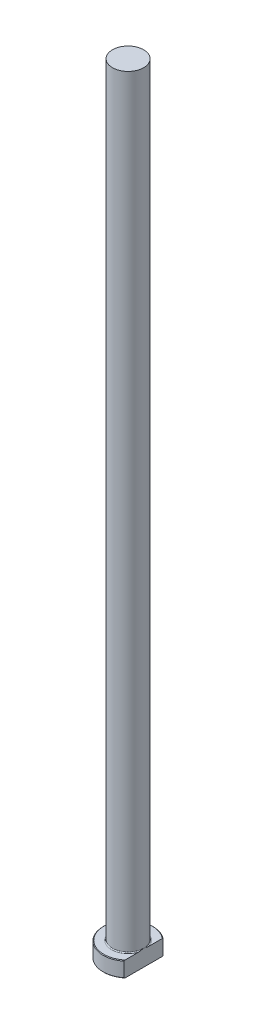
from build123d import *
from build123d.topology import SkipClean

# Parameters (mm, degrees)
CHAMFER1_SIZE = 0.2
FILLET1_R     = 0.3
KEY_DEPTH     = 251.255869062


with BuildPart() as part:
    # Sketch1 → Revolve1 (revolve)
    with BuildSketch(Plane.XY, mode=Mode.PRIVATE) as revolve1_sk:
        Polygon((0, 0), (-8, 0), (-8, 5), (-5, 5), (-5, 250), (0, 250), align=None)
    revolve(revolve1_sk.sketch.rotate(Axis((0, 259.958771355, 0), (0, -1, 0)), 270), axis=Axis((0, 259.958771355, 0), (0, -1, 0)))

    # Chamfer1
    chamfer1_edges = [part.edges().sort_by_distance(p)[0] for p in [
        (0, 5, -8),
        (0, 0, -8),
    ]]
    chamfer(chamfer1_edges, length=CHAMFER1_SIZE)

    # Fillet1
    fillet1_edges = [part.edges().sort_by_distance(p)[0] for p in [
        (0, 5, -5),
    ]]
    fillet(fillet1_edges, radius=FILLET1_R)

    # Sketch2 → KEY (cut, through all)
    with SkipClean():  # the faces are left unmerged after this step: merging them gives an invalid solid
        with BuildSketch(Plane(origin=(0, 0, 0), x_dir=(1, 0, 0), z_dir=(0, 1, 0))):
            with BuildLine():
                Line((5, 6.244997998), (5, -6.244997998))
                ThreePointArc((5, -6.244997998), (8, 0), (5, 6.244997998))
            make_face()
        extrude(amount=KEY_DEPTH, mode=Mode.SUBTRACT)


solid = part.part
